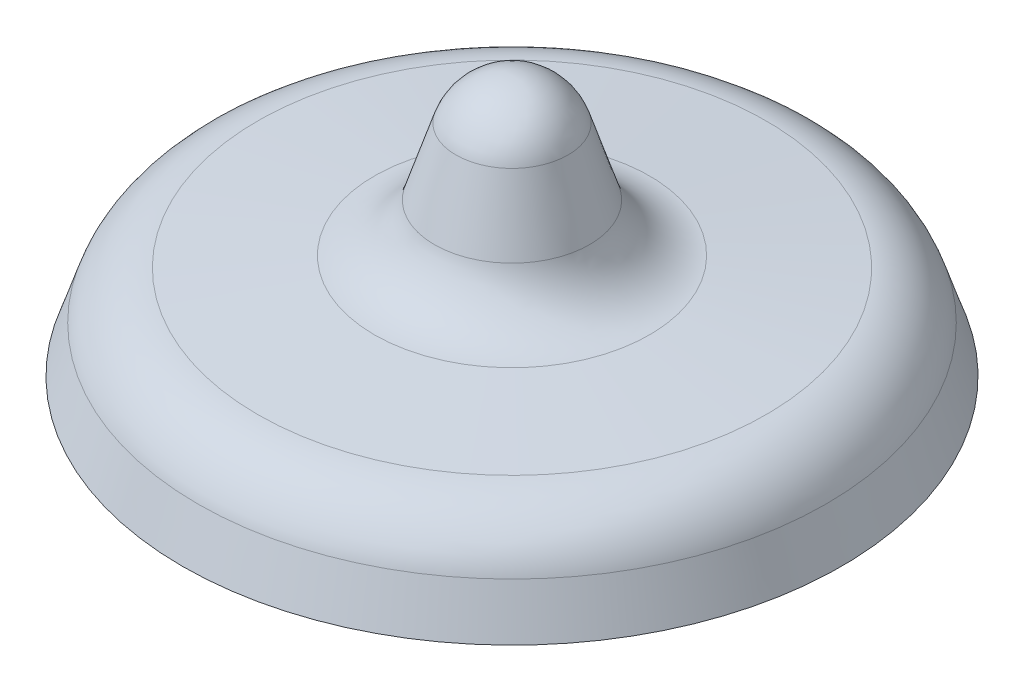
from build123d import *


with BuildPart() as part:
    # Sketch1 → Revolve1 (revolve)
    with BuildSketch(Plane.XY, mode=Mode.PRIVATE) as revolve1_sk:
        with BuildLine():
            Line((0, 0), (111.581714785, 0))
            Line((111.581714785, 0), (106.375097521, 15.686559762))
            ThreePointArc((106.375097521, 15.686559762), (98.639333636, 26.750369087), (86.108319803, 31.772680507))
            Line((86.108319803, 31.772680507), (46.599654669, 35.396897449))
            ThreePointArc((46.599654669, 35.396897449), (33.990744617, 40.48130466), (26.270912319, 51.672372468))
            Line((26.270912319, 51.672372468), (18.970659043, 74.303157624))
            ThreePointArc((18.970659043, 74.303157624), (11.733542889, 84.297527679), (0, 88.116854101))
            Line((0, 88.116854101), (0, 0))
        make_face()
    revolve(revolve1_sk.sketch.rotate(Axis((0, 0, 0), (0, -1, 0)), 90), axis=Axis((0, 0, 0), (0, -1, 0)))


solid = part.part
